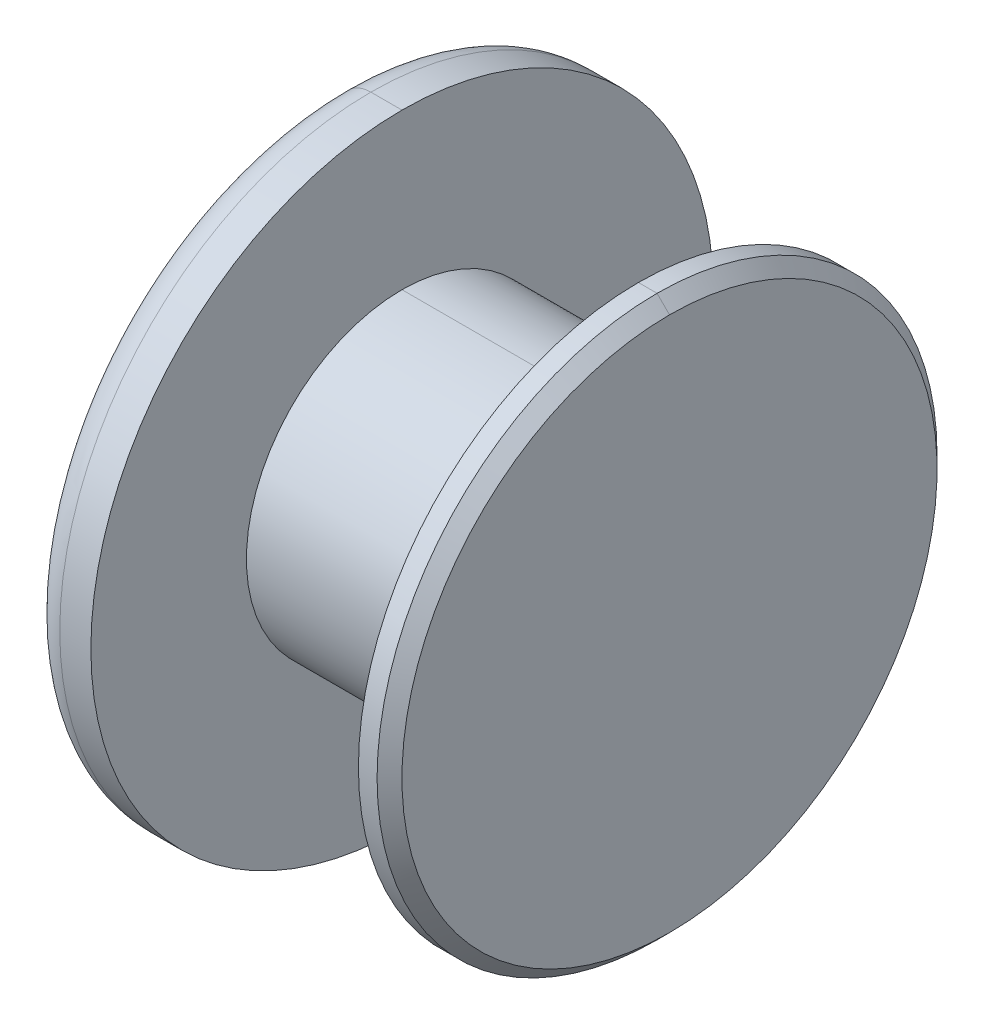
ISO-10303-21;
HEADER;
FILE_DESCRIPTION(('STEP AP214'),'2;1');
FILE_NAME('part.step','',(''),(''),'','','');
FILE_SCHEMA(('AUTOMOTIVE_DESIGN { 1 0 10303 214 1 1 1 1 }'));
ENDSEC;
DATA;
#1=APPLICATION_CONTEXT('core data for automotive mechanical design processes');
#2=APPLICATION_PROTOCOL_DEFINITION('international standard','automotive_design',2000,#1);
#3=PRODUCT_CONTEXT('',#1,'mechanical');
#4=PRODUCT('Part','Part','',(#3));
#5=PRODUCT_RELATED_PRODUCT_CATEGORY('part','',(#4));
#6=PRODUCT_DEFINITION_FORMATION('','',#4);
#7=PRODUCT_DEFINITION_CONTEXT('part definition',#1,'design');
#8=PRODUCT_DEFINITION('design','',#6,#7);
#9=PRODUCT_DEFINITION_SHAPE('','',#8);
#10=(LENGTH_UNIT() NAMED_UNIT(*) SI_UNIT(.MILLI.,.METRE.));
#11=(NAMED_UNIT(*) PLANE_ANGLE_UNIT() SI_UNIT($,.RADIAN.));
#12=(NAMED_UNIT(*) SI_UNIT($,.STERADIAN.) SOLID_ANGLE_UNIT());
#13=UNCERTAINTY_MEASURE_WITH_UNIT(LENGTH_MEASURE(1.E-05),#10,'distance_accuracy_value','');
#14=(GEOMETRIC_REPRESENTATION_CONTEXT(3) GLOBAL_UNCERTAINTY_ASSIGNED_CONTEXT((#13)) GLOBAL_UNIT_ASSIGNED_CONTEXT((#10,
#11,#12)) REPRESENTATION_CONTEXT('',''));
#15=CARTESIAN_POINT('',(0.,0.,0.));
#16=DIRECTION('',(0.,0.,1.));
#17=DIRECTION('',(1.,0.,0.));
#18=AXIS2_PLACEMENT_3D('',#15,#16,#17);
#19=CARTESIAN_POINT('',(2.45,0.,0.));
#20=DIRECTION('',(-1.,0.,0.));
#21=DIRECTION('',(0.,-1.,0.));
#22=AXIS2_PLACEMENT_3D('',#19,#20,#21);
#23=CONICAL_SURFACE('',#22,4.5,0.78539816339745);
#24=DIRECTION('',(-0.707106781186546,0.707106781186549,0.));
#25=VECTOR('',#24,1.);
#26=CARTESIAN_POINT('',(2.45,4.5,0.));
#27=LINE('',#26,#25);
#28=CARTESIAN_POINT('',(2.65,4.3,0.));
#29=VERTEX_POINT('',#28);
#30=CARTESIAN_POINT('',(2.45,4.5,0.));
#31=VERTEX_POINT('',#30);
#32=EDGE_CURVE('E163',#29,#31,#27,.T.);
#33=ORIENTED_EDGE('',*,*,#32,.F.);
#34=CARTESIAN_POINT('',(2.65,0.,0.));
#35=DIRECTION('',(1.,0.,0.));
#36=DIRECTION('',(0.,-1.,0.));
#37=AXIS2_PLACEMENT_3D('',#34,#35,#36);
#38=CIRCLE('',#37,4.3);
#39=CARTESIAN_POINT('',(2.65,-4.3,0.));
#40=VERTEX_POINT('',#39);
#41=EDGE_CURVE('E146',#40,#29,#38,.T.);
#42=ORIENTED_EDGE('',*,*,#41,.F.);
#43=DIRECTION('',(-0.707106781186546,-0.707106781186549,0.));
#44=VECTOR('',#43,1.);
#45=CARTESIAN_POINT('',(2.45,-4.5,0.));
#46=LINE('',#45,#44);
#47=CARTESIAN_POINT('',(2.45,-4.5,0.));
#48=VERTEX_POINT('',#47);
#49=EDGE_CURVE('E151',#40,#48,#46,.T.);
#50=ORIENTED_EDGE('',*,*,#49,.T.);
#51=CARTESIAN_POINT('',(2.45,0.,0.));
#52=DIRECTION('',(-1.,0.,0.));
#53=DIRECTION('',(0.,-1.,0.));
#54=AXIS2_PLACEMENT_3D('',#51,#52,#53);
#55=CIRCLE('',#54,4.5);
#56=EDGE_CURVE('E11',#31,#48,#55,.T.);
#57=ORIENTED_EDGE('',*,*,#56,.F.);
#58=EDGE_LOOP('',(#33,#42,#50,#57));
#59=FACE_BOUND('',#58,.T.);
#60=ADVANCED_FACE('F17',(#59),#23,.T.);
#61=CARTESIAN_POINT('',(-2.15,0.,0.));
#62=DIRECTION('',(1.,0.,0.));
#63=DIRECTION('',(0.,1.,0.));
#64=AXIS2_PLACEMENT_3D('',#61,#62,#63);
#65=TOROIDAL_SURFACE('',#64,4.5,0.5);
#66=CARTESIAN_POINT('',(-2.15,-4.5,0.));
#67=DIRECTION('',(0.,0.,1.));
#68=DIRECTION('',(0.,-1.,0.));
#69=AXIS2_PLACEMENT_3D('',#66,#67,#68);
#70=CIRCLE('',#69,0.5);
#71=CARTESIAN_POINT('',(-2.65,-4.5,0.));
#72=VERTEX_POINT('',#71);
#73=CARTESIAN_POINT('',(-2.15,-5.,0.));
#74=VERTEX_POINT('',#73);
#75=EDGE_CURVE('E132',#72,#74,#70,.T.);
#76=ORIENTED_EDGE('',*,*,#75,.F.);
#77=CARTESIAN_POINT('',(-2.65,0.,0.));
#78=DIRECTION('',(-1.,0.,0.));
#79=DIRECTION('',(0.,1.,0.));
#80=AXIS2_PLACEMENT_3D('',#77,#78,#79);
#81=CIRCLE('',#80,4.5);
#82=CARTESIAN_POINT('',(-2.65,4.5,0.));
#83=VERTEX_POINT('',#82);
#84=EDGE_CURVE('E124',#83,#72,#81,.T.);
#85=ORIENTED_EDGE('',*,*,#84,.F.);
#86=CARTESIAN_POINT('',(-2.15,4.5,0.));
#87=DIRECTION('',(0.,0.,-1.));
#88=DIRECTION('',(-1.,0.,0.));
#89=AXIS2_PLACEMENT_3D('',#86,#87,#88);
#90=CIRCLE('',#89,0.5);
#91=CARTESIAN_POINT('',(-2.15,5.,0.));
#92=VERTEX_POINT('',#91);
#93=EDGE_CURVE('E122',#83,#92,#90,.T.);
#94=ORIENTED_EDGE('',*,*,#93,.T.);
#95=CARTESIAN_POINT('',(-2.15,0.,0.));
#96=DIRECTION('',(1.,0.,0.));
#97=DIRECTION('',(0.,1.,0.));
#98=AXIS2_PLACEMENT_3D('',#95,#96,#97);
#99=CIRCLE('',#98,5.);
#100=EDGE_CURVE('E100',#74,#92,#99,.T.);
#101=ORIENTED_EDGE('',*,*,#100,.F.);
#102=EDGE_LOOP('',(#76,#85,#94,#101));
#103=FACE_BOUND('',#102,.T.);
#104=ADVANCED_FACE('F123',(#103),#65,.T.);
#105=CARTESIAN_POINT('',(-2.65,0.,0.));
#106=DIRECTION('',(-1.,0.,0.));
#107=DIRECTION('',(0.,-1.,0.));
#108=AXIS2_PLACEMENT_3D('',#105,#106,#107);
#109=CYLINDRICAL_SURFACE('',#108,4.5);
#110=DIRECTION('',(-1.,0.,0.));
#111=VECTOR('',#110,1.);
#112=CARTESIAN_POINT('',(-2.65,4.5,0.));
#113=LINE('',#112,#111);
#114=CARTESIAN_POINT('',(2.15,4.5,0.));
#115=VERTEX_POINT('',#114);
#116=EDGE_CURVE('E129',#31,#115,#113,.T.);
#117=ORIENTED_EDGE('',*,*,#116,.F.);
#118=ORIENTED_EDGE('',*,*,#56,.T.);
#119=DIRECTION('',(-1.,0.,0.));
#120=VECTOR('',#119,1.);
#121=CARTESIAN_POINT('',(-2.65,-4.5,0.));
#122=LINE('',#121,#120);
#123=CARTESIAN_POINT('',(2.15,-4.5,0.));
#124=VERTEX_POINT('',#123);
#125=EDGE_CURVE('E165',#48,#124,#122,.T.);
#126=ORIENTED_EDGE('',*,*,#125,.T.);
#127=CARTESIAN_POINT('',(2.15,0.,0.));
#128=DIRECTION('',(-1.,0.,0.));
#129=DIRECTION('',(0.,-1.,0.));
#130=AXIS2_PLACEMENT_3D('',#127,#128,#129);
#131=CIRCLE('',#130,4.5);
#132=EDGE_CURVE('E28',#115,#124,#131,.T.);
#133=ORIENTED_EDGE('',*,*,#132,.F.);
#134=EDGE_LOOP('',(#117,#118,#126,#133));
#135=FACE_BOUND('',#134,.T.);
#136=ADVANCED_FACE('F212',(#135),#109,.T.);
#137=CARTESIAN_POINT('',(2.15,2.5,0.));
#138=DIRECTION('',(1.,0.,0.));
#139=DIRECTION('',(0.,1.,0.));
#140=AXIS2_PLACEMENT_3D('',#137,#138,#139);
#141=PLANE('',#140);
#142=CARTESIAN_POINT('',(2.15,0.,0.));
#143=DIRECTION('',(-1.,0.,0.));
#144=DIRECTION('',(0.,-1.,0.));
#145=AXIS2_PLACEMENT_3D('',#142,#143,#144);
#146=CIRCLE('',#145,2.5);
#147=CARTESIAN_POINT('',(2.15,-2.5,0.));
#148=VERTEX_POINT('',#147);
#149=CARTESIAN_POINT('',(2.15,2.5,0.));
#150=VERTEX_POINT('',#149);
#151=EDGE_CURVE('E159',#148,#150,#146,.T.);
#152=ORIENTED_EDGE('',*,*,#151,.F.);
#153=CARTESIAN_POINT('',(2.15,0.,0.));
#154=DIRECTION('',(-1.,0.,0.));
#155=DIRECTION('',(0.,-1.,0.));
#156=AXIS2_PLACEMENT_3D('',#153,#154,#155);
#157=CIRCLE('',#156,2.5);
#158=EDGE_CURVE('E195',#150,#148,#157,.T.);
#159=ORIENTED_EDGE('',*,*,#158,.F.);
#160=EDGE_LOOP('',(#152,#159));
#161=FACE_BOUND('',#160,.T.);
#162=CARTESIAN_POINT('',(2.15,0.,0.));
#163=DIRECTION('',(-1.,0.,0.));
#164=DIRECTION('',(0.,-1.,0.));
#165=AXIS2_PLACEMENT_3D('',#162,#163,#164);
#166=CIRCLE('',#165,4.5);
#167=EDGE_CURVE('E145',#124,#115,#166,.T.);
#168=ORIENTED_EDGE('',*,*,#167,.T.);
#169=ORIENTED_EDGE('',*,*,#132,.T.);
#170=EDGE_LOOP('',(#168,#169));
#171=FACE_BOUND('',#170,.T.);
#172=ADVANCED_FACE('F217',(#161,#171),#141,.F.);
#173=CARTESIAN_POINT('',(-2.65,0.,0.));
#174=DIRECTION('',(-1.,0.,0.));
#175=DIRECTION('',(0.,-1.,0.));
#176=AXIS2_PLACEMENT_3D('',#173,#174,#175);
#177=CYLINDRICAL_SURFACE('',#176,2.5);
#178=DIRECTION('',(-1.,0.,0.));
#179=VECTOR('',#178,1.);
#180=CARTESIAN_POINT('',(-2.65,2.5,0.));
#181=LINE('',#180,#179);
#182=CARTESIAN_POINT('',(-1.65,2.5,0.));
#183=VERTEX_POINT('',#182);
#184=EDGE_CURVE('E154',#150,#183,#181,.T.);
#185=ORIENTED_EDGE('',*,*,#184,.F.);
#186=ORIENTED_EDGE('',*,*,#158,.T.);
#187=DIRECTION('',(-1.,0.,0.));
#188=VECTOR('',#187,1.);
#189=CARTESIAN_POINT('',(-2.65,-2.5,0.));
#190=LINE('',#189,#188);
#191=CARTESIAN_POINT('',(-1.65,-2.5,0.));
#192=VERTEX_POINT('',#191);
#193=EDGE_CURVE('E172',#148,#192,#190,.T.);
#194=ORIENTED_EDGE('',*,*,#193,.T.);
#195=CARTESIAN_POINT('',(-1.65,0.,0.));
#196=DIRECTION('',(-1.,0.,0.));
#197=DIRECTION('',(0.,-1.,0.));
#198=AXIS2_PLACEMENT_3D('',#195,#196,#197);
#199=CIRCLE('',#198,2.5);
#200=EDGE_CURVE('E112',#183,#192,#199,.T.);
#201=ORIENTED_EDGE('',*,*,#200,.F.);
#202=EDGE_LOOP('',(#185,#186,#194,#201));
#203=FACE_BOUND('',#202,.T.);
#204=ADVANCED_FACE('F219',(#203),#177,.T.);
#205=CARTESIAN_POINT('',(-1.65,5.,0.));
#206=DIRECTION('',(-1.,0.,0.));
#207=DIRECTION('',(0.,1.,0.));
#208=AXIS2_PLACEMENT_3D('',#205,#206,#207);
#209=PLANE('',#208);
#210=CARTESIAN_POINT('',(-1.65,0.,0.));
#211=DIRECTION('',(-1.,0.,0.));
#212=DIRECTION('',(0.,-1.,0.));
#213=AXIS2_PLACEMENT_3D('',#210,#211,#212);
#214=CIRCLE('',#213,2.5);
#215=EDGE_CURVE('E158',#192,#183,#214,.T.);
#216=ORIENTED_EDGE('',*,*,#215,.T.);
#217=ORIENTED_EDGE('',*,*,#200,.T.);
#218=EDGE_LOOP('',(#216,#217));
#219=FACE_BOUND('',#218,.T.);
#220=CARTESIAN_POINT('',(-1.65,0.,0.));
#221=DIRECTION('',(-1.,0.,0.));
#222=DIRECTION('',(0.,-1.,0.));
#223=AXIS2_PLACEMENT_3D('',#220,#221,#222);
#224=CIRCLE('',#223,5.);
#225=CARTESIAN_POINT('',(-1.65,-5.,0.));
#226=VERTEX_POINT('',#225);
#227=CARTESIAN_POINT('',(-1.65,5.,0.));
#228=VERTEX_POINT('',#227);
#229=EDGE_CURVE('E21',#226,#228,#224,.T.);
#230=ORIENTED_EDGE('',*,*,#229,.F.);
#231=CARTESIAN_POINT('',(-1.65,0.,0.));
#232=DIRECTION('',(-1.,0.,0.));
#233=DIRECTION('',(0.,-1.,0.));
#234=AXIS2_PLACEMENT_3D('',#231,#232,#233);
#235=CIRCLE('',#234,5.);
#236=EDGE_CURVE('E42',#228,#226,#235,.T.);
#237=ORIENTED_EDGE('',*,*,#236,.F.);
#238=EDGE_LOOP('',(#230,#237));
#239=FACE_BOUND('',#238,.T.);
#240=ADVANCED_FACE('F227',(#219,#239),#209,.F.);
#241=CARTESIAN_POINT('',(-2.65,0.,0.));
#242=DIRECTION('',(-1.,0.,0.));
#243=DIRECTION('',(0.,-1.,0.));
#244=AXIS2_PLACEMENT_3D('',#241,#242,#243);
#245=CYLINDRICAL_SURFACE('',#244,5.);
#246=DIRECTION('',(-1.,0.,0.));
#247=VECTOR('',#246,1.);
#248=CARTESIAN_POINT('',(-2.65,5.,0.));
#249=LINE('',#248,#247);
#250=EDGE_CURVE('E103',#228,#92,#249,.T.);
#251=ORIENTED_EDGE('',*,*,#250,.F.);
#252=ORIENTED_EDGE('',*,*,#236,.T.);
#253=DIRECTION('',(-1.,0.,0.));
#254=VECTOR('',#253,1.);
#255=CARTESIAN_POINT('',(-2.65,-5.,0.));
#256=LINE('',#255,#254);
#257=EDGE_CURVE('E106',#226,#74,#256,.T.);
#258=ORIENTED_EDGE('',*,*,#257,.T.);
#259=ORIENTED_EDGE('',*,*,#100,.T.);
#260=EDGE_LOOP('',(#251,#252,#258,#259));
#261=FACE_BOUND('',#260,.T.);
#262=ADVANCED_FACE('F102',(#261),#245,.T.);
#263=CARTESIAN_POINT('',(-2.65,0.,0.));
#264=DIRECTION('',(1.,0.,0.));
#265=DIRECTION('',(0.,1.,0.));
#266=AXIS2_PLACEMENT_3D('',#263,#264,#265);
#267=PLANE('',#266);
#268=ORIENTED_EDGE('',*,*,#84,.T.);
#269=CARTESIAN_POINT('',(-2.65,0.,0.));
#270=DIRECTION('',(-1.,0.,0.));
#271=DIRECTION('',(0.,1.,0.));
#272=AXIS2_PLACEMENT_3D('',#269,#270,#271);
#273=CIRCLE('',#272,4.5);
#274=EDGE_CURVE('E139',#72,#83,#273,.T.);
#275=ORIENTED_EDGE('',*,*,#274,.T.);
#276=EDGE_LOOP('',(#268,#275));
#277=FACE_BOUND('',#276,.T.);
#278=ADVANCED_FACE('F250',(#277),#267,.F.);
#279=CARTESIAN_POINT('',(2.65,4.5,0.));
#280=DIRECTION('',(-1.,0.,0.));
#281=DIRECTION('',(0.,1.,0.));
#282=AXIS2_PLACEMENT_3D('',#279,#280,#281);
#283=PLANE('',#282);
#284=ORIENTED_EDGE('',*,*,#41,.T.);
#285=CARTESIAN_POINT('',(2.65,0.,0.));
#286=DIRECTION('',(1.,0.,0.));
#287=DIRECTION('',(0.,-1.,0.));
#288=AXIS2_PLACEMENT_3D('',#285,#286,#287);
#289=CIRCLE('',#288,4.3);
#290=EDGE_CURVE('E160',#29,#40,#289,.T.);
#291=ORIENTED_EDGE('',*,*,#290,.T.);
#292=EDGE_LOOP('',(#284,#291));
#293=FACE_BOUND('',#292,.T.);
#294=ADVANCED_FACE('F243',(#293),#283,.F.);
#295=CARTESIAN_POINT('',(-2.65,0.,0.));
#296=DIRECTION('',(-1.,0.,0.));
#297=DIRECTION('',(0.,-1.,0.));
#298=AXIS2_PLACEMENT_3D('',#295,#296,#297);
#299=CYLINDRICAL_SURFACE('',#298,5.);
#300=ORIENTED_EDGE('',*,*,#229,.T.);
#301=ORIENTED_EDGE('',*,*,#250,.T.);
#302=CARTESIAN_POINT('',(-2.15,0.,0.));
#303=DIRECTION('',(1.,0.,0.));
#304=DIRECTION('',(0.,1.,0.));
#305=AXIS2_PLACEMENT_3D('',#302,#303,#304);
#306=CIRCLE('',#305,5.);
#307=EDGE_CURVE('E117',#92,#74,#306,.T.);
#308=ORIENTED_EDGE('',*,*,#307,.T.);
#309=ORIENTED_EDGE('',*,*,#257,.F.);
#310=EDGE_LOOP('',(#300,#301,#308,#309));
#311=FACE_BOUND('',#310,.T.);
#312=ADVANCED_FACE('F115',(#311),#299,.T.);
#313=CARTESIAN_POINT('',(-2.65,0.,0.));
#314=DIRECTION('',(-1.,0.,0.));
#315=DIRECTION('',(0.,-1.,0.));
#316=AXIS2_PLACEMENT_3D('',#313,#314,#315);
#317=CYLINDRICAL_SURFACE('',#316,2.5);
#318=ORIENTED_EDGE('',*,*,#151,.T.);
#319=ORIENTED_EDGE('',*,*,#184,.T.);
#320=ORIENTED_EDGE('',*,*,#215,.F.);
#321=ORIENTED_EDGE('',*,*,#193,.F.);
#322=EDGE_LOOP('',(#318,#319,#320,#321));
#323=FACE_BOUND('',#322,.T.);
#324=ADVANCED_FACE('F242',(#323),#317,.T.);
#325=CARTESIAN_POINT('',(-2.65,0.,0.));
#326=DIRECTION('',(-1.,0.,0.));
#327=DIRECTION('',(0.,-1.,0.));
#328=AXIS2_PLACEMENT_3D('',#325,#326,#327);
#329=CYLINDRICAL_SURFACE('',#328,4.5);
#330=CARTESIAN_POINT('',(2.45,0.,0.));
#331=DIRECTION('',(-1.,0.,0.));
#332=DIRECTION('',(0.,-1.,0.));
#333=AXIS2_PLACEMENT_3D('',#330,#331,#332);
#334=CIRCLE('',#333,4.5);
#335=EDGE_CURVE('E178',#48,#31,#334,.T.);
#336=ORIENTED_EDGE('',*,*,#335,.T.);
#337=ORIENTED_EDGE('',*,*,#116,.T.);
#338=ORIENTED_EDGE('',*,*,#167,.F.);
#339=ORIENTED_EDGE('',*,*,#125,.F.);
#340=EDGE_LOOP('',(#336,#337,#338,#339));
#341=FACE_BOUND('',#340,.T.);
#342=ADVANCED_FACE('F215',(#341),#329,.T.);
#343=CARTESIAN_POINT('',(-2.15,0.,0.));
#344=DIRECTION('',(1.,0.,0.));
#345=DIRECTION('',(0.,1.,0.));
#346=AXIS2_PLACEMENT_3D('',#343,#344,#345);
#347=TOROIDAL_SURFACE('',#346,4.5,0.5);
#348=ORIENTED_EDGE('',*,*,#274,.F.);
#349=ORIENTED_EDGE('',*,*,#75,.T.);
#350=ORIENTED_EDGE('',*,*,#307,.F.);
#351=ORIENTED_EDGE('',*,*,#93,.F.);
#352=EDGE_LOOP('',(#348,#349,#350,#351));
#353=FACE_BOUND('',#352,.T.);
#354=ADVANCED_FACE('F131',(#353),#347,.T.);
#355=CARTESIAN_POINT('',(2.45,0.,0.));
#356=DIRECTION('',(-1.,0.,0.));
#357=DIRECTION('',(0.,-1.,0.));
#358=AXIS2_PLACEMENT_3D('',#355,#356,#357);
#359=CONICAL_SURFACE('',#358,4.5,0.78539816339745);
#360=ORIENTED_EDGE('',*,*,#290,.F.);
#361=ORIENTED_EDGE('',*,*,#32,.T.);
#362=ORIENTED_EDGE('',*,*,#335,.F.);
#363=ORIENTED_EDGE('',*,*,#49,.F.);
#364=EDGE_LOOP('',(#360,#361,#362,#363));
#365=FACE_BOUND('',#364,.T.);
#366=ADVANCED_FACE('F19',(#365),#359,.T.);
#367=CLOSED_SHELL('',(#60,#104,#136,#172,#204,#240,#262,#278,#294,#312,#324,#342,#354,#366));
#368=MANIFOLD_SOLID_BREP('B1',#367);
#369=ADVANCED_BREP_SHAPE_REPRESENTATION('',(#18,#368),#14);
#370=SHAPE_DEFINITION_REPRESENTATION(#9,#369);
ENDSEC;
END-ISO-10303-21;
